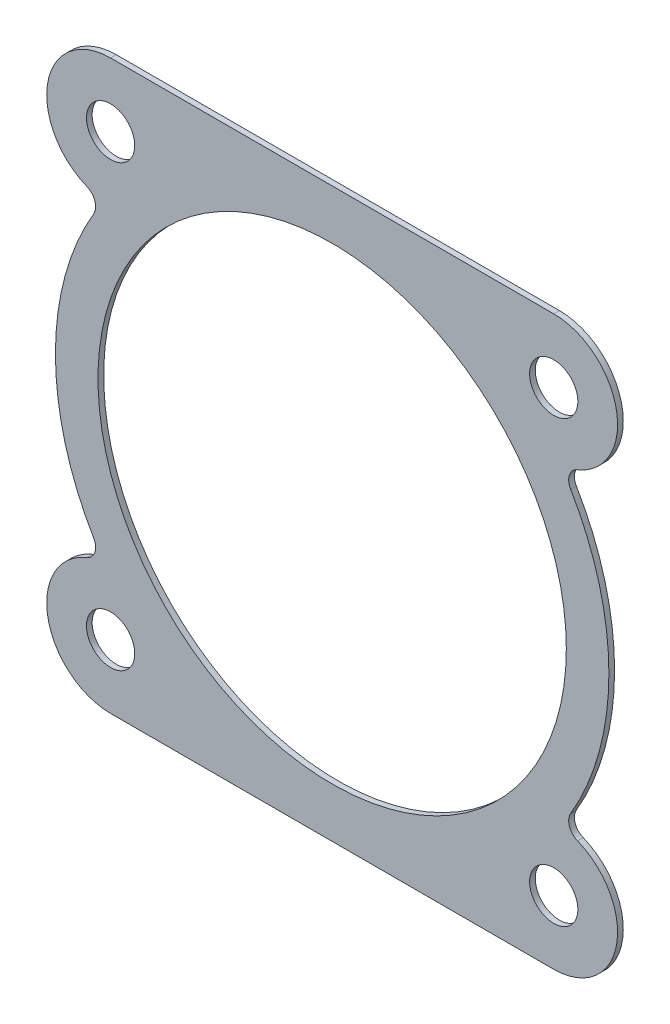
ISO-10303-21;
HEADER;
FILE_DESCRIPTION(('STEP AP214'),'2;1');
FILE_NAME('part.step','',(''),(''),'','','');
FILE_SCHEMA(('AUTOMOTIVE_DESIGN { 1 0 10303 214 1 1 1 1 }'));
ENDSEC;
DATA;
#1=APPLICATION_CONTEXT('core data for automotive mechanical design processes');
#2=APPLICATION_PROTOCOL_DEFINITION('international standard','automotive_design',2000,#1);
#3=PRODUCT_CONTEXT('',#1,'mechanical');
#4=PRODUCT('Part','Part','',(#3));
#5=PRODUCT_RELATED_PRODUCT_CATEGORY('part','',(#4));
#6=PRODUCT_DEFINITION_FORMATION('','',#4);
#7=PRODUCT_DEFINITION_CONTEXT('part definition',#1,'design');
#8=PRODUCT_DEFINITION('design','',#6,#7);
#9=PRODUCT_DEFINITION_SHAPE('','',#8);
#10=(LENGTH_UNIT() NAMED_UNIT(*) SI_UNIT(.MILLI.,.METRE.));
#11=(NAMED_UNIT(*) PLANE_ANGLE_UNIT() SI_UNIT($,.RADIAN.));
#12=(NAMED_UNIT(*) SI_UNIT($,.STERADIAN.) SOLID_ANGLE_UNIT());
#13=UNCERTAINTY_MEASURE_WITH_UNIT(LENGTH_MEASURE(1.E-05),#10,'distance_accuracy_value','');
#14=(GEOMETRIC_REPRESENTATION_CONTEXT(3) GLOBAL_UNCERTAINTY_ASSIGNED_CONTEXT((#13)) GLOBAL_UNIT_ASSIGNED_CONTEXT((#10,
#11,#12)) REPRESENTATION_CONTEXT('',''));
#15=CARTESIAN_POINT('',(0.,0.,0.));
#16=DIRECTION('',(0.,0.,1.));
#17=DIRECTION('',(1.,0.,0.));
#18=AXIS2_PLACEMENT_3D('',#15,#16,#17);
#19=CARTESIAN_POINT('',(-17.6671332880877,-10.398190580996,0.2));
#20=DIRECTION('',(0.,0.,-1.));
#21=DIRECTION('',(-1.,0.,0.));
#22=AXIS2_PLACEMENT_3D('',#19,#20,#21);
#23=CYLINDRICAL_SURFACE('',#22,0.99999968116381);
#24=CARTESIAN_POINT('',(-17.6671332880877,-10.398190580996,-0.2));
#25=DIRECTION('',(0.,0.,-1.));
#26=DIRECTION('',(-1.,0.,0.));
#27=AXIS2_PLACEMENT_3D('',#24,#25,#26);
#28=CIRCLE('',#27,0.99999968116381);
#29=CARTESIAN_POINT('',(-16.8053221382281,-9.89096193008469,-0.2));
#30=VERTEX_POINT('',#29);
#31=CARTESIAN_POINT('',(-17.2935626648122,-11.3257919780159,-0.2));
#32=VERTEX_POINT('',#31);
#33=EDGE_CURVE('E124',#30,#32,#28,.T.);
#34=ORIENTED_EDGE('',*,*,#33,.T.);
#35=DIRECTION('',(0.,0.,-1.));
#36=VECTOR('',#35,1.);
#37=CARTESIAN_POINT('',(-17.2935626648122,-11.3257919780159,0.2));
#38=LINE('',#37,#36);
#39=CARTESIAN_POINT('',(-17.2935626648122,-11.3257919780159,0.2));
#40=VERTEX_POINT('',#39);
#41=EDGE_CURVE('E11',#40,#32,#38,.T.);
#42=ORIENTED_EDGE('',*,*,#41,.F.);
#43=CARTESIAN_POINT('',(-17.6671332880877,-10.398190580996,0.2));
#44=DIRECTION('',(0.,0.,-1.));
#45=DIRECTION('',(-1.,0.,0.));
#46=AXIS2_PLACEMENT_3D('',#43,#44,#45);
#47=CIRCLE('',#46,0.99999968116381);
#48=CARTESIAN_POINT('',(-16.8053221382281,-9.89096193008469,0.2));
#49=VERTEX_POINT('',#48);
#50=EDGE_CURVE('E164',#49,#40,#47,.T.);
#51=ORIENTED_EDGE('',*,*,#50,.F.);
#52=DIRECTION('',(0.,0.,-1.));
#53=VECTOR('',#52,1.);
#54=CARTESIAN_POINT('',(-16.8053221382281,-9.89096193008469,0.2));
#55=LINE('',#54,#53);
#56=EDGE_CURVE('E137',#49,#30,#55,.T.);
#57=ORIENTED_EDGE('',*,*,#56,.T.);
#58=EDGE_LOOP('',(#34,#42,#51,#57));
#59=FACE_BOUND('',#58,.T.);
#60=ADVANCED_FACE('F32',(#59),#23,.F.);
#61=CARTESIAN_POINT('',(-15.6124942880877,-15.499999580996,0.2));
#62=DIRECTION('',(0.,0.,-1.));
#63=DIRECTION('',(-1.,0.,0.));
#64=AXIS2_PLACEMENT_3D('',#61,#62,#63);
#65=CYLINDRICAL_SURFACE('',#64,4.5);
#66=CARTESIAN_POINT('',(-15.6124942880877,-15.499999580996,-0.2));
#67=DIRECTION('',(0.,0.,1.));
#68=DIRECTION('',(-1.,0.,0.));
#69=AXIS2_PLACEMENT_3D('',#66,#67,#68);
#70=CIRCLE('',#69,4.5);
#71=CARTESIAN_POINT('',(-15.612495,-19.9999995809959,-0.2));
#72=VERTEX_POINT('',#71);
#73=EDGE_CURVE('E120',#32,#72,#70,.T.);
#74=ORIENTED_EDGE('',*,*,#73,.T.);
#75=DIRECTION('',(0.,0.,-1.));
#76=VECTOR('',#75,1.);
#77=CARTESIAN_POINT('',(-15.612495,-19.9999995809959,0.2));
#78=LINE('',#77,#76);
#79=CARTESIAN_POINT('',(-15.612495,-19.9999995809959,0.2));
#80=VERTEX_POINT('',#79);
#81=EDGE_CURVE('E39',#80,#72,#78,.T.);
#82=ORIENTED_EDGE('',*,*,#81,.F.);
#83=CARTESIAN_POINT('',(-15.6124942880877,-15.499999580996,0.2));
#84=DIRECTION('',(0.,0.,1.));
#85=DIRECTION('',(-1.,0.,0.));
#86=AXIS2_PLACEMENT_3D('',#83,#84,#85);
#87=CIRCLE('',#86,4.5);
#88=EDGE_CURVE('E133',#40,#80,#87,.T.);
#89=ORIENTED_EDGE('',*,*,#88,.F.);
#90=ORIENTED_EDGE('',*,*,#41,.T.);
#91=EDGE_LOOP('',(#74,#82,#89,#90));
#92=FACE_BOUND('',#91,.T.);
#93=ADVANCED_FACE('F132',(#92),#65,.T.);
#94=CARTESIAN_POINT('',(-15.612495,-19.9999995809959,0.2));
#95=DIRECTION('',(0.,1.,0.));
#96=DIRECTION('',(-1.,0.,0.));
#97=AXIS2_PLACEMENT_3D('',#94,#95,#96);
#98=PLANE('',#97);
#99=DIRECTION('',(1.,0.,0.));
#100=VECTOR('',#99,1.);
#101=CARTESIAN_POINT('',(-15.612495,-19.9999995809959,-0.2));
#102=LINE('',#101,#100);
#103=CARTESIAN_POINT('',(15.612495,-19.9999995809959,-0.2));
#104=VERTEX_POINT('',#103);
#105=EDGE_CURVE('E126',#72,#104,#102,.T.);
#106=ORIENTED_EDGE('',*,*,#105,.T.);
#107=DIRECTION('',(0.,0.,-1.));
#108=VECTOR('',#107,1.);
#109=CARTESIAN_POINT('',(15.612495,-19.9999995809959,0.2));
#110=LINE('',#109,#108);
#111=CARTESIAN_POINT('',(15.612495,-19.9999995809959,0.2));
#112=VERTEX_POINT('',#111);
#113=EDGE_CURVE('E210',#112,#104,#110,.T.);
#114=ORIENTED_EDGE('',*,*,#113,.F.);
#115=DIRECTION('',(1.,0.,0.));
#116=VECTOR('',#115,1.);
#117=CARTESIAN_POINT('',(-15.612495,-19.9999995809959,0.2));
#118=LINE('',#117,#116);
#119=EDGE_CURVE('E167',#80,#112,#118,.T.);
#120=ORIENTED_EDGE('',*,*,#119,.F.);
#121=ORIENTED_EDGE('',*,*,#81,.T.);
#122=EDGE_LOOP('',(#106,#114,#120,#121));
#123=FACE_BOUND('',#122,.T.);
#124=ADVANCED_FACE('F214',(#123),#98,.F.);
#125=CARTESIAN_POINT('',(15.6124942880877,-15.499999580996,0.2));
#126=DIRECTION('',(0.,0.,-1.));
#127=DIRECTION('',(-1.,0.,0.));
#128=AXIS2_PLACEMENT_3D('',#125,#126,#127);
#129=CYLINDRICAL_SURFACE('',#128,4.5);
#130=CARTESIAN_POINT('',(15.6124942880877,-15.499999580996,-0.2));
#131=DIRECTION('',(0.,0.,1.));
#132=DIRECTION('',(1.,0.,0.));
#133=AXIS2_PLACEMENT_3D('',#130,#131,#132);
#134=CIRCLE('',#133,4.5);
#135=CARTESIAN_POINT('',(17.2935626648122,-11.3257919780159,-0.2));
#136=VERTEX_POINT('',#135);
#137=EDGE_CURVE('E146',#104,#136,#134,.T.);
#138=ORIENTED_EDGE('',*,*,#137,.T.);
#139=DIRECTION('',(0.,0.,-1.));
#140=VECTOR('',#139,1.);
#141=CARTESIAN_POINT('',(17.2935626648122,-11.3257919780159,0.2));
#142=LINE('',#141,#140);
#143=CARTESIAN_POINT('',(17.2935626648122,-11.3257919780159,0.2));
#144=VERTEX_POINT('',#143);
#145=EDGE_CURVE('E207',#144,#136,#142,.T.);
#146=ORIENTED_EDGE('',*,*,#145,.F.);
#147=CARTESIAN_POINT('',(15.6124942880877,-15.499999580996,0.2));
#148=DIRECTION('',(0.,0.,1.));
#149=DIRECTION('',(1.,0.,0.));
#150=AXIS2_PLACEMENT_3D('',#147,#148,#149);
#151=CIRCLE('',#150,4.5);
#152=EDGE_CURVE('E169',#112,#144,#151,.T.);
#153=ORIENTED_EDGE('',*,*,#152,.F.);
#154=ORIENTED_EDGE('',*,*,#113,.T.);
#155=EDGE_LOOP('',(#138,#146,#153,#154));
#156=FACE_BOUND('',#155,.T.);
#157=ADVANCED_FACE('F222',(#156),#129,.T.);
#158=CARTESIAN_POINT('',(17.6671332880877,-10.398190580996,0.2));
#159=DIRECTION('',(0.,0.,-1.));
#160=DIRECTION('',(-1.,0.,0.));
#161=AXIS2_PLACEMENT_3D('',#158,#159,#160);
#162=CYLINDRICAL_SURFACE('',#161,0.99999968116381);
#163=CARTESIAN_POINT('',(17.6671332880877,-10.398190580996,-0.2));
#164=DIRECTION('',(0.,0.,-1.));
#165=DIRECTION('',(1.,0.,0.));
#166=AXIS2_PLACEMENT_3D('',#163,#164,#165);
#167=CIRCLE('',#166,0.99999968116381);
#168=CARTESIAN_POINT('',(16.8053221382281,-9.89096193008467,-0.2));
#169=VERTEX_POINT('',#168);
#170=EDGE_CURVE('E148',#136,#169,#167,.T.);
#171=ORIENTED_EDGE('',*,*,#170,.T.);
#172=DIRECTION('',(0.,0.,-1.));
#173=VECTOR('',#172,1.);
#174=CARTESIAN_POINT('',(16.8053221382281,-9.89096193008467,0.2));
#175=LINE('',#174,#173);
#176=CARTESIAN_POINT('',(16.8053221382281,-9.89096193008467,0.2));
#177=VERTEX_POINT('',#176);
#178=EDGE_CURVE('E204',#177,#169,#175,.T.);
#179=ORIENTED_EDGE('',*,*,#178,.F.);
#180=CARTESIAN_POINT('',(17.6671332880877,-10.398190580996,0.2));
#181=DIRECTION('',(0.,0.,-1.));
#182=DIRECTION('',(1.,0.,0.));
#183=AXIS2_PLACEMENT_3D('',#180,#181,#182);
#184=CIRCLE('',#183,0.99999968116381);
#185=EDGE_CURVE('E171',#144,#177,#184,.T.);
#186=ORIENTED_EDGE('',*,*,#185,.F.);
#187=ORIENTED_EDGE('',*,*,#145,.T.);
#188=EDGE_LOOP('',(#171,#179,#186,#187));
#189=FACE_BOUND('',#188,.T.);
#190=ADVANCED_FACE('F225',(#189),#162,.F.);
#191=CARTESIAN_POINT('',(0.,0.,0.2));
#192=DIRECTION('',(0.,0.,-1.));
#193=DIRECTION('',(-1.,0.,0.));
#194=AXIS2_PLACEMENT_3D('',#191,#192,#193);
#195=CYLINDRICAL_SURFACE('',#194,19.4999994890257);
#196=CARTESIAN_POINT('',(0.,0.,-0.2));
#197=DIRECTION('',(0.,0.,1.));
#198=DIRECTION('',(1.,0.,0.));
#199=AXIS2_PLACEMENT_3D('',#196,#197,#198);
#200=CIRCLE('',#199,19.4999994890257);
#201=CARTESIAN_POINT('',(16.8053225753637,9.89096118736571,-0.2));
#202=VERTEX_POINT('',#201);
#203=EDGE_CURVE('E150',#169,#202,#200,.T.);
#204=ORIENTED_EDGE('',*,*,#203,.T.);
#205=DIRECTION('',(0.,0.,-1.));
#206=VECTOR('',#205,1.);
#207=CARTESIAN_POINT('',(16.8053225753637,9.89096118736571,0.2));
#208=LINE('',#207,#206);
#209=CARTESIAN_POINT('',(16.8053225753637,9.89096118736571,0.2));
#210=VERTEX_POINT('',#209);
#211=EDGE_CURVE('E201',#210,#202,#208,.T.);
#212=ORIENTED_EDGE('',*,*,#211,.F.);
#213=CARTESIAN_POINT('',(0.,0.,0.2));
#214=DIRECTION('',(0.,0.,1.));
#215=DIRECTION('',(1.,0.,0.));
#216=AXIS2_PLACEMENT_3D('',#213,#214,#215);
#217=CIRCLE('',#216,19.4999994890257);
#218=EDGE_CURVE('E173',#177,#210,#217,.T.);
#219=ORIENTED_EDGE('',*,*,#218,.F.);
#220=ORIENTED_EDGE('',*,*,#178,.T.);
#221=EDGE_LOOP('',(#204,#212,#219,#220));
#222=FACE_BOUND('',#221,.T.);
#223=ADVANCED_FACE('F230',(#222),#195,.T.);
#224=CARTESIAN_POINT('',(17.667134,10.39819,0.2));
#225=DIRECTION('',(0.,0.,-1.));
#226=DIRECTION('',(-1.,0.,0.));
#227=AXIS2_PLACEMENT_3D('',#224,#225,#226);
#228=CYLINDRICAL_SURFACE('',#227,1.00000000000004);
#229=CARTESIAN_POINT('',(17.667134,10.39819,-0.2));
#230=DIRECTION('',(0.,0.,-1.));
#231=DIRECTION('',(1.,0.,0.));
#232=AXIS2_PLACEMENT_3D('',#229,#230,#231);
#233=CIRCLE('',#232,1.00000000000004);
#234=CARTESIAN_POINT('',(17.2935636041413,11.3257918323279,-0.2));
#235=VERTEX_POINT('',#234);
#236=EDGE_CURVE('E152',#202,#235,#233,.T.);
#237=ORIENTED_EDGE('',*,*,#236,.T.);
#238=DIRECTION('',(0.,0.,-1.));
#239=VECTOR('',#238,1.);
#240=CARTESIAN_POINT('',(17.2935636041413,11.3257918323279,0.2));
#241=LINE('',#240,#239);
#242=CARTESIAN_POINT('',(17.2935636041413,11.3257918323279,0.2));
#243=VERTEX_POINT('',#242);
#244=EDGE_CURVE('E198',#243,#235,#241,.T.);
#245=ORIENTED_EDGE('',*,*,#244,.F.);
#246=CARTESIAN_POINT('',(17.667134,10.39819,0.2));
#247=DIRECTION('',(0.,0.,-1.));
#248=DIRECTION('',(1.,0.,0.));
#249=AXIS2_PLACEMENT_3D('',#246,#247,#248);
#250=CIRCLE('',#249,1.00000000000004);
#251=EDGE_CURVE('E175',#210,#243,#250,.T.);
#252=ORIENTED_EDGE('',*,*,#251,.F.);
#253=ORIENTED_EDGE('',*,*,#211,.T.);
#254=EDGE_LOOP('',(#237,#245,#252,#253));
#255=FACE_BOUND('',#254,.T.);
#256=ADVANCED_FACE('F236',(#255),#228,.F.);
#257=CARTESIAN_POINT('',(15.6124952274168,15.499999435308,0.2));
#258=DIRECTION('',(0.,0.,-1.));
#259=DIRECTION('',(-1.,0.,0.));
#260=AXIS2_PLACEMENT_3D('',#257,#258,#259);
#261=CYLINDRICAL_SURFACE('',#260,4.5);
#262=CARTESIAN_POINT('',(15.6124952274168,15.499999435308,-0.2));
#263=DIRECTION('',(0.,0.,1.));
#264=DIRECTION('',(1.,0.,0.));
#265=AXIS2_PLACEMENT_3D('',#262,#263,#264);
#266=CIRCLE('',#265,4.5);
#267=CARTESIAN_POINT('',(15.6124952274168,19.999999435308,-0.2));
#268=VERTEX_POINT('',#267);
#269=EDGE_CURVE('E154',#235,#268,#266,.T.);
#270=ORIENTED_EDGE('',*,*,#269,.T.);
#271=DIRECTION('',(0.,0.,-1.));
#272=VECTOR('',#271,1.);
#273=CARTESIAN_POINT('',(15.6124952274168,19.999999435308,0.2));
#274=LINE('',#273,#272);
#275=CARTESIAN_POINT('',(15.6124952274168,19.999999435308,0.2));
#276=VERTEX_POINT('',#275);
#277=EDGE_CURVE('E195',#276,#268,#274,.T.);
#278=ORIENTED_EDGE('',*,*,#277,.F.);
#279=CARTESIAN_POINT('',(15.6124952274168,15.499999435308,0.2));
#280=DIRECTION('',(0.,0.,1.));
#281=DIRECTION('',(1.,0.,0.));
#282=AXIS2_PLACEMENT_3D('',#279,#280,#281);
#283=CIRCLE('',#282,4.5);
#284=EDGE_CURVE('E177',#243,#276,#283,.T.);
#285=ORIENTED_EDGE('',*,*,#284,.F.);
#286=ORIENTED_EDGE('',*,*,#244,.T.);
#287=EDGE_LOOP('',(#270,#278,#285,#286));
#288=FACE_BOUND('',#287,.T.);
#289=ADVANCED_FACE('F240',(#288),#261,.T.);
#290=CARTESIAN_POINT('',(15.6124952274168,19.999999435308,0.2));
#291=DIRECTION('',(-1.81500077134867E-08,-1.,0.));
#292=DIRECTION('',(1.,-1.81500077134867E-08,0.));
#293=AXIS2_PLACEMENT_3D('',#290,#291,#292);
#294=PLANE('',#293);
#295=DIRECTION('',(-1.,1.81500077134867E-08,0.));
#296=VECTOR('',#295,1.);
#297=CARTESIAN_POINT('',(15.6124952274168,19.999999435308,-0.2));
#298=LINE('',#297,#296);
#299=CARTESIAN_POINT('',(-15.6124951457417,19.9999997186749,-0.2));
#300=VERTEX_POINT('',#299);
#301=EDGE_CURVE('E156',#268,#300,#298,.T.);
#302=ORIENTED_EDGE('',*,*,#301,.T.);
#303=DIRECTION('',(0.,0.,-1.));
#304=VECTOR('',#303,1.);
#305=CARTESIAN_POINT('',(-15.6124951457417,19.9999997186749,0.2));
#306=LINE('',#305,#304);
#307=CARTESIAN_POINT('',(-15.6124951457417,19.9999997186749,0.2));
#308=VERTEX_POINT('',#307);
#309=EDGE_CURVE('E192',#308,#300,#306,.T.);
#310=ORIENTED_EDGE('',*,*,#309,.F.);
#311=DIRECTION('',(-1.,1.81500077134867E-08,0.));
#312=VECTOR('',#311,1.);
#313=CARTESIAN_POINT('',(15.6124952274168,19.999999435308,0.2));
#314=LINE('',#313,#312);
#315=EDGE_CURVE('E179',#276,#308,#314,.T.);
#316=ORIENTED_EDGE('',*,*,#315,.F.);
#317=ORIENTED_EDGE('',*,*,#277,.T.);
#318=EDGE_LOOP('',(#302,#310,#316,#317));
#319=FACE_BOUND('',#318,.T.);
#320=ADVANCED_FACE('F245',(#319),#294,.F.);
#321=CARTESIAN_POINT('',(-15.6124952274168,15.499999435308,0.2));
#322=DIRECTION('',(0.,0.,-1.));
#323=DIRECTION('',(-1.,0.,0.));
#324=AXIS2_PLACEMENT_3D('',#321,#322,#323);
#325=CYLINDRICAL_SURFACE('',#324,4.50000028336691);
#326=CARTESIAN_POINT('',(-15.6124952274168,15.499999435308,-0.2));
#327=DIRECTION('',(0.,0.,1.));
#328=DIRECTION('',(-1.,0.,0.));
#329=AXIS2_PLACEMENT_3D('',#326,#327,#328);
#330=CIRCLE('',#329,4.50000028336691);
#331=CARTESIAN_POINT('',(-17.2935636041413,11.3257918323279,-0.2));
#332=VERTEX_POINT('',#331);
#333=EDGE_CURVE('E158',#300,#332,#330,.T.);
#334=ORIENTED_EDGE('',*,*,#333,.T.);
#335=DIRECTION('',(0.,0.,-1.));
#336=VECTOR('',#335,1.);
#337=CARTESIAN_POINT('',(-17.2935636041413,11.3257918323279,0.2));
#338=LINE('',#337,#336);
#339=CARTESIAN_POINT('',(-17.2935636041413,11.3257918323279,0.2));
#340=VERTEX_POINT('',#339);
#341=EDGE_CURVE('E189',#340,#332,#338,.T.);
#342=ORIENTED_EDGE('',*,*,#341,.F.);
#343=CARTESIAN_POINT('',(-15.6124952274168,15.499999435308,0.2));
#344=DIRECTION('',(0.,0.,1.));
#345=DIRECTION('',(-1.,0.,0.));
#346=AXIS2_PLACEMENT_3D('',#343,#344,#345);
#347=CIRCLE('',#346,4.50000028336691);
#348=EDGE_CURVE('E181',#308,#340,#347,.T.);
#349=ORIENTED_EDGE('',*,*,#348,.F.);
#350=ORIENTED_EDGE('',*,*,#309,.T.);
#351=EDGE_LOOP('',(#334,#342,#349,#350));
#352=FACE_BOUND('',#351,.T.);
#353=ADVANCED_FACE('F249',(#352),#325,.T.);
#354=CARTESIAN_POINT('',(-17.667134,10.39819,0.2));
#355=DIRECTION('',(0.,0.,-1.));
#356=DIRECTION('',(-1.,0.,0.));
#357=AXIS2_PLACEMENT_3D('',#354,#355,#356);
#358=CYLINDRICAL_SURFACE('',#357,1.00000000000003);
#359=CARTESIAN_POINT('',(-17.667134,10.39819,-0.2));
#360=DIRECTION('',(0.,0.,-1.));
#361=DIRECTION('',(-1.,0.,0.));
#362=AXIS2_PLACEMENT_3D('',#359,#360,#361);
#363=CIRCLE('',#362,1.00000000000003);
#364=CARTESIAN_POINT('',(-16.8053225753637,9.8909611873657,-0.2));
#365=VERTEX_POINT('',#364);
#366=EDGE_CURVE('E160',#332,#365,#363,.T.);
#367=ORIENTED_EDGE('',*,*,#366,.T.);
#368=DIRECTION('',(0.,0.,-1.));
#369=VECTOR('',#368,1.);
#370=CARTESIAN_POINT('',(-16.8053225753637,9.8909611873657,0.2));
#371=LINE('',#370,#369);
#372=CARTESIAN_POINT('',(-16.8053225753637,9.8909611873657,0.2));
#373=VERTEX_POINT('',#372);
#374=EDGE_CURVE('E186',#373,#365,#371,.T.);
#375=ORIENTED_EDGE('',*,*,#374,.F.);
#376=CARTESIAN_POINT('',(-17.667134,10.39819,0.2));
#377=DIRECTION('',(0.,0.,-1.));
#378=DIRECTION('',(-1.,0.,0.));
#379=AXIS2_PLACEMENT_3D('',#376,#377,#378);
#380=CIRCLE('',#379,1.00000000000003);
#381=EDGE_CURVE('E51',#340,#373,#380,.T.);
#382=ORIENTED_EDGE('',*,*,#381,.F.);
#383=ORIENTED_EDGE('',*,*,#341,.T.);
#384=EDGE_LOOP('',(#367,#375,#382,#383));
#385=FACE_BOUND('',#384,.T.);
#386=ADVANCED_FACE('F253',(#385),#358,.F.);
#387=CARTESIAN_POINT('',(0.,0.,0.2));
#388=DIRECTION('',(0.,0.,-1.));
#389=DIRECTION('',(-1.,0.,0.));
#390=AXIS2_PLACEMENT_3D('',#387,#388,#389);
#391=CYLINDRICAL_SURFACE('',#390,19.4999994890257);
#392=CARTESIAN_POINT('',(0.,0.,-0.2));
#393=DIRECTION('',(0.,0.,1.));
#394=DIRECTION('',(-1.,0.,0.));
#395=AXIS2_PLACEMENT_3D('',#392,#393,#394);
#396=CIRCLE('',#395,19.4999994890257);
#397=EDGE_CURVE('E162',#365,#30,#396,.T.);
#398=ORIENTED_EDGE('',*,*,#397,.T.);
#399=ORIENTED_EDGE('',*,*,#56,.F.);
#400=CARTESIAN_POINT('',(0.,0.,0.2));
#401=DIRECTION('',(0.,0.,1.));
#402=DIRECTION('',(-1.,0.,0.));
#403=AXIS2_PLACEMENT_3D('',#400,#401,#402);
#404=CIRCLE('',#403,19.4999994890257);
#405=EDGE_CURVE('E46',#373,#49,#404,.T.);
#406=ORIENTED_EDGE('',*,*,#405,.F.);
#407=ORIENTED_EDGE('',*,*,#374,.T.);
#408=EDGE_LOOP('',(#398,#399,#406,#407));
#409=FACE_BOUND('',#408,.T.);
#410=ADVANCED_FACE('F255',(#409),#391,.T.);
#411=CARTESIAN_POINT('',(-17.6671332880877,-10.398190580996,0.2));
#412=DIRECTION('',(0.,0.,-1.));
#413=DIRECTION('',(-1.,0.,0.));
#414=AXIS2_PLACEMENT_3D('',#411,#412,#413);
#415=PLANE('',#414);
#416=CARTESIAN_POINT('',(0.,0.,0.2));
#417=DIRECTION('',(0.,0.,1.));
#418=DIRECTION('',(1.,0.,0.));
#419=AXIS2_PLACEMENT_3D('',#416,#417,#418);
#420=CIRCLE('',#419,16.5);
#421=CARTESIAN_POINT('',(16.5,0.,0.2));
#422=VERTEX_POINT('',#421);
#423=EDGE_CURVE('E374',#422,#422,#420,.T.);
#424=ORIENTED_EDGE('',*,*,#423,.F.);
#425=EDGE_LOOP('',(#424));
#426=FACE_BOUND('',#425,.T.);
#427=CARTESIAN_POINT('',(15.6124952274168,15.499999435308,0.200000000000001));
#428=DIRECTION('',(0.,0.,1.));
#429=DIRECTION('',(1.,0.,0.));
#430=AXIS2_PLACEMENT_3D('',#427,#428,#429);
#431=CIRCLE('',#430,1.69999999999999);
#432=CARTESIAN_POINT('',(17.3124952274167,15.499999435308,0.200000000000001));
#433=VERTEX_POINT('',#432);
#434=EDGE_CURVE('E376',#433,#433,#431,.T.);
#435=ORIENTED_EDGE('',*,*,#434,.F.);
#436=EDGE_LOOP('',(#435));
#437=FACE_BOUND('',#436,.T.);
#438=CARTESIAN_POINT('',(-15.6124952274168,15.499999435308,0.200000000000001));
#439=DIRECTION('',(0.,0.,1.));
#440=DIRECTION('',(1.,0.,0.));
#441=AXIS2_PLACEMENT_3D('',#438,#439,#440);
#442=CIRCLE('',#441,1.69999999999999);
#443=CARTESIAN_POINT('',(-13.9124952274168,15.499999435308,0.200000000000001));
#444=VERTEX_POINT('',#443);
#445=EDGE_CURVE('E384',#444,#444,#442,.T.);
#446=ORIENTED_EDGE('',*,*,#445,.F.);
#447=EDGE_LOOP('',(#446));
#448=FACE_BOUND('',#447,.T.);
#449=CARTESIAN_POINT('',(-15.6124942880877,-15.499999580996,0.200000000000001));
#450=DIRECTION('',(0.,0.,1.));
#451=DIRECTION('',(1.,0.,0.));
#452=AXIS2_PLACEMENT_3D('',#449,#450,#451);
#453=CIRCLE('',#452,1.69999999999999);
#454=CARTESIAN_POINT('',(-13.9124942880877,-15.499999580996,0.200000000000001));
#455=VERTEX_POINT('',#454);
#456=EDGE_CURVE('E390',#455,#455,#453,.T.);
#457=ORIENTED_EDGE('',*,*,#456,.F.);
#458=EDGE_LOOP('',(#457));
#459=FACE_BOUND('',#458,.T.);
#460=CARTESIAN_POINT('',(15.6124942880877,-15.499999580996,0.200000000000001));
#461=DIRECTION('',(0.,0.,1.));
#462=DIRECTION('',(1.,0.,0.));
#463=AXIS2_PLACEMENT_3D('',#460,#461,#462);
#464=CIRCLE('',#463,1.69999999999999);
#465=CARTESIAN_POINT('',(17.3124942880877,-15.499999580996,0.200000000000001));
#466=VERTEX_POINT('',#465);
#467=EDGE_CURVE('E141',#466,#466,#464,.T.);
#468=ORIENTED_EDGE('',*,*,#467,.F.);
#469=EDGE_LOOP('',(#468));
#470=FACE_BOUND('',#469,.T.);
#471=ORIENTED_EDGE('',*,*,#50,.T.);
#472=ORIENTED_EDGE('',*,*,#88,.T.);
#473=ORIENTED_EDGE('',*,*,#119,.T.);
#474=ORIENTED_EDGE('',*,*,#152,.T.);
#475=ORIENTED_EDGE('',*,*,#185,.T.);
#476=ORIENTED_EDGE('',*,*,#218,.T.);
#477=ORIENTED_EDGE('',*,*,#251,.T.);
#478=ORIENTED_EDGE('',*,*,#284,.T.);
#479=ORIENTED_EDGE('',*,*,#315,.T.);
#480=ORIENTED_EDGE('',*,*,#348,.T.);
#481=ORIENTED_EDGE('',*,*,#381,.T.);
#482=ORIENTED_EDGE('',*,*,#405,.T.);
#483=EDGE_LOOP('',(#471,#472,#473,#474,#475,#476,#477,#478,#479,#480,#481,#482));
#484=FACE_BOUND('',#483,.T.);
#485=ADVANCED_FACE('F217',(#426,#437,#448,#459,#470,#484),#415,.F.);
#486=CARTESIAN_POINT('',(-17.6671332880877,-10.398190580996,-0.2));
#487=DIRECTION('',(0.,0.,-1.));
#488=DIRECTION('',(-1.,0.,0.));
#489=AXIS2_PLACEMENT_3D('',#486,#487,#488);
#490=PLANE('',#489);
#491=CARTESIAN_POINT('',(0.,0.,-0.2));
#492=DIRECTION('',(0.,0.,1.));
#493=DIRECTION('',(1.,0.,0.));
#494=AXIS2_PLACEMENT_3D('',#491,#492,#493);
#495=CIRCLE('',#494,16.5);
#496=CARTESIAN_POINT('',(16.5,0.,-0.2));
#497=VERTEX_POINT('',#496);
#498=EDGE_CURVE('E371',#497,#497,#495,.T.);
#499=ORIENTED_EDGE('',*,*,#498,.T.);
#500=EDGE_LOOP('',(#499));
#501=FACE_BOUND('',#500,.T.);
#502=CARTESIAN_POINT('',(15.6124952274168,15.499999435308,-0.2));
#503=DIRECTION('',(0.,0.,1.));
#504=DIRECTION('',(1.,0.,0.));
#505=AXIS2_PLACEMENT_3D('',#502,#503,#504);
#506=CIRCLE('',#505,1.7);
#507=CARTESIAN_POINT('',(17.3124952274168,15.499999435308,-0.2));
#508=VERTEX_POINT('',#507);
#509=EDGE_CURVE('E381',#508,#508,#506,.T.);
#510=ORIENTED_EDGE('',*,*,#509,.T.);
#511=EDGE_LOOP('',(#510));
#512=FACE_BOUND('',#511,.T.);
#513=CARTESIAN_POINT('',(-15.6124952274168,15.499999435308,-0.2));
#514=DIRECTION('',(0.,0.,1.));
#515=DIRECTION('',(1.,0.,0.));
#516=AXIS2_PLACEMENT_3D('',#513,#514,#515);
#517=CIRCLE('',#516,1.7);
#518=CARTESIAN_POINT('',(-13.9124952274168,15.499999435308,-0.2));
#519=VERTEX_POINT('',#518);
#520=EDGE_CURVE('E387',#519,#519,#517,.T.);
#521=ORIENTED_EDGE('',*,*,#520,.T.);
#522=EDGE_LOOP('',(#521));
#523=FACE_BOUND('',#522,.T.);
#524=CARTESIAN_POINT('',(-15.6124942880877,-15.499999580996,-0.2));
#525=DIRECTION('',(0.,0.,1.));
#526=DIRECTION('',(1.,0.,0.));
#527=AXIS2_PLACEMENT_3D('',#524,#525,#526);
#528=CIRCLE('',#527,1.7);
#529=CARTESIAN_POINT('',(-13.9124942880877,-15.499999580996,-0.2));
#530=VERTEX_POINT('',#529);
#531=EDGE_CURVE('E393',#530,#530,#528,.T.);
#532=ORIENTED_EDGE('',*,*,#531,.T.);
#533=EDGE_LOOP('',(#532));
#534=FACE_BOUND('',#533,.T.);
#535=CARTESIAN_POINT('',(15.6124942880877,-15.499999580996,-0.2));
#536=DIRECTION('',(0.,0.,1.));
#537=DIRECTION('',(1.,0.,0.));
#538=AXIS2_PLACEMENT_3D('',#535,#536,#537);
#539=CIRCLE('',#538,1.7);
#540=CARTESIAN_POINT('',(17.3124942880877,-15.499999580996,-0.2));
#541=VERTEX_POINT('',#540);
#542=EDGE_CURVE('E138',#541,#541,#539,.T.);
#543=ORIENTED_EDGE('',*,*,#542,.T.);
#544=EDGE_LOOP('',(#543));
#545=FACE_BOUND('',#544,.T.);
#546=ORIENTED_EDGE('',*,*,#33,.F.);
#547=ORIENTED_EDGE('',*,*,#397,.F.);
#548=ORIENTED_EDGE('',*,*,#366,.F.);
#549=ORIENTED_EDGE('',*,*,#333,.F.);
#550=ORIENTED_EDGE('',*,*,#301,.F.);
#551=ORIENTED_EDGE('',*,*,#269,.F.);
#552=ORIENTED_EDGE('',*,*,#236,.F.);
#553=ORIENTED_EDGE('',*,*,#203,.F.);
#554=ORIENTED_EDGE('',*,*,#170,.F.);
#555=ORIENTED_EDGE('',*,*,#137,.F.);
#556=ORIENTED_EDGE('',*,*,#105,.F.);
#557=ORIENTED_EDGE('',*,*,#73,.F.);
#558=EDGE_LOOP('',(#546,#547,#548,#549,#550,#551,#552,#553,#554,#555,#556,#557));
#559=FACE_BOUND('',#558,.T.);
#560=ADVANCED_FACE('F121',(#501,#512,#523,#534,#545,#559),#490,.T.);
#561=CARTESIAN_POINT('',(15.6124942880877,-15.499999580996,0.2));
#562=DIRECTION('',(0.,0.,1.));
#563=DIRECTION('',(1.,0.,0.));
#564=AXIS2_PLACEMENT_3D('',#561,#562,#563);
#565=CYLINDRICAL_SURFACE('',#564,1.69999999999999);
#566=ORIENTED_EDGE('',*,*,#542,.F.);
#567=EDGE_LOOP('',(#566));
#568=FACE_BOUND('',#567,.T.);
#569=ORIENTED_EDGE('',*,*,#467,.T.);
#570=EDGE_LOOP('',(#569));
#571=FACE_BOUND('',#570,.T.);
#572=ADVANCED_FACE('F314',(#568,#571),#565,.F.);
#573=CARTESIAN_POINT('',(-15.6124942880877,-15.499999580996,0.2));
#574=DIRECTION('',(0.,0.,1.));
#575=DIRECTION('',(1.,0.,0.));
#576=AXIS2_PLACEMENT_3D('',#573,#574,#575);
#577=CYLINDRICAL_SURFACE('',#576,1.69999999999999);
#578=ORIENTED_EDGE('',*,*,#531,.F.);
#579=EDGE_LOOP('',(#578));
#580=FACE_BOUND('',#579,.T.);
#581=ORIENTED_EDGE('',*,*,#456,.T.);
#582=EDGE_LOOP('',(#581));
#583=FACE_BOUND('',#582,.T.);
#584=ADVANCED_FACE('F324',(#580,#583),#577,.F.);
#585=CARTESIAN_POINT('',(-15.6124952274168,15.499999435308,0.2));
#586=DIRECTION('',(0.,0.,1.));
#587=DIRECTION('',(1.,0.,0.));
#588=AXIS2_PLACEMENT_3D('',#585,#586,#587);
#589=CYLINDRICAL_SURFACE('',#588,1.69999999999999);
#590=ORIENTED_EDGE('',*,*,#520,.F.);
#591=EDGE_LOOP('',(#590));
#592=FACE_BOUND('',#591,.T.);
#593=ORIENTED_EDGE('',*,*,#445,.T.);
#594=EDGE_LOOP('',(#593));
#595=FACE_BOUND('',#594,.T.);
#596=ADVANCED_FACE('F334',(#592,#595),#589,.F.);
#597=CARTESIAN_POINT('',(15.6124952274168,15.499999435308,0.2));
#598=DIRECTION('',(0.,0.,1.));
#599=DIRECTION('',(1.,0.,0.));
#600=AXIS2_PLACEMENT_3D('',#597,#598,#599);
#601=CYLINDRICAL_SURFACE('',#600,1.69999999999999);
#602=ORIENTED_EDGE('',*,*,#509,.F.);
#603=EDGE_LOOP('',(#602));
#604=FACE_BOUND('',#603,.T.);
#605=ORIENTED_EDGE('',*,*,#434,.T.);
#606=EDGE_LOOP('',(#605));
#607=FACE_BOUND('',#606,.T.);
#608=ADVANCED_FACE('F344',(#604,#607),#601,.F.);
#609=CARTESIAN_POINT('',(0.,0.,-0.2));
#610=DIRECTION('',(0.,0.,1.));
#611=DIRECTION('',(1.,0.,0.));
#612=AXIS2_PLACEMENT_3D('',#609,#610,#611);
#613=CYLINDRICAL_SURFACE('',#612,16.5);
#614=ORIENTED_EDGE('',*,*,#498,.F.);
#615=EDGE_LOOP('',(#614));
#616=FACE_BOUND('',#615,.T.);
#617=ORIENTED_EDGE('',*,*,#423,.T.);
#618=EDGE_LOOP('',(#617));
#619=FACE_BOUND('',#618,.T.);
#620=ADVANCED_FACE('F354',(#616,#619),#613,.F.);
#621=CLOSED_SHELL('',(#60,#93,#124,#157,#190,#223,#256,#289,#320,#353,#386,#410,#485,#560,#572,
#584,#596,#608,#620));
#622=MANIFOLD_SOLID_BREP('B2',#621);
#623=ADVANCED_BREP_SHAPE_REPRESENTATION('',(#18,#622),#14);
#624=SHAPE_DEFINITION_REPRESENTATION(#9,#623);
ENDSEC;
END-ISO-10303-21;
